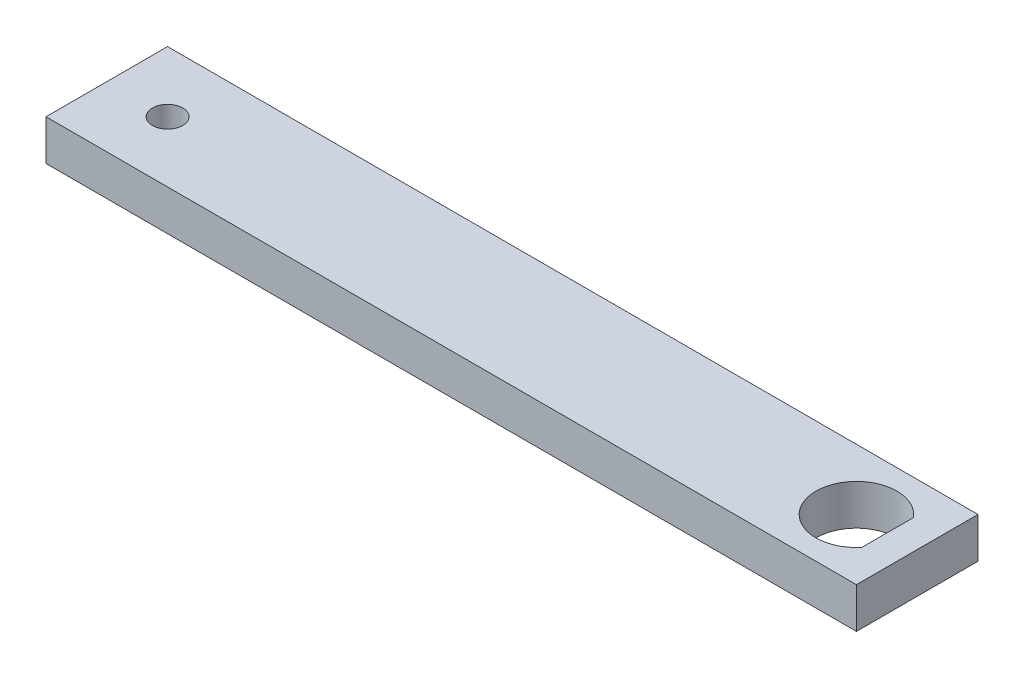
ISO-10303-21;
HEADER;
FILE_DESCRIPTION(('STEP AP214'),'2;1');
FILE_NAME('part.step','',(''),(''),'','','');
FILE_SCHEMA(('AUTOMOTIVE_DESIGN { 1 0 10303 214 1 1 1 1 }'));
ENDSEC;
DATA;
#1=APPLICATION_CONTEXT('core data for automotive mechanical design processes');
#2=APPLICATION_PROTOCOL_DEFINITION('international standard','automotive_design',2000,#1);
#3=PRODUCT_CONTEXT('',#1,'mechanical');
#4=PRODUCT('Part','Part','',(#3));
#5=PRODUCT_RELATED_PRODUCT_CATEGORY('part','',(#4));
#6=PRODUCT_DEFINITION_FORMATION('','',#4);
#7=PRODUCT_DEFINITION_CONTEXT('part definition',#1,'design');
#8=PRODUCT_DEFINITION('design','',#6,#7);
#9=PRODUCT_DEFINITION_SHAPE('','',#8);
#10=(LENGTH_UNIT() NAMED_UNIT(*) SI_UNIT(.MILLI.,.METRE.));
#11=(NAMED_UNIT(*) PLANE_ANGLE_UNIT() SI_UNIT($,.RADIAN.));
#12=(NAMED_UNIT(*) SI_UNIT($,.STERADIAN.) SOLID_ANGLE_UNIT());
#13=UNCERTAINTY_MEASURE_WITH_UNIT(LENGTH_MEASURE(1.E-05),#10,'distance_accuracy_value','');
#14=(GEOMETRIC_REPRESENTATION_CONTEXT(3) GLOBAL_UNCERTAINTY_ASSIGNED_CONTEXT((#13)) GLOBAL_UNIT_ASSIGNED_CONTEXT((#10,
#11,#12)) REPRESENTATION_CONTEXT('',''));
#15=CARTESIAN_POINT('',(0.,0.,0.));
#16=DIRECTION('',(0.,0.,1.));
#17=DIRECTION('',(1.,0.,0.));
#18=AXIS2_PLACEMENT_3D('',#15,#16,#17);
#19=CARTESIAN_POINT('',(0.,0.,19.05));
#20=DIRECTION('',(-1.,0.,0.));
#21=DIRECTION('',(0.,0.,1.));
#22=AXIS2_PLACEMENT_3D('',#19,#20,#21);
#23=PLANE('',#22);
#24=DIRECTION('',(0.,1.,0.));
#25=VECTOR('',#24,1.);
#26=CARTESIAN_POINT('',(0.,0.,0.));
#27=LINE('',#26,#25);
#28=CARTESIAN_POINT('',(0.,0.,0.));
#29=VERTEX_POINT('',#28);
#30=CARTESIAN_POINT('',(0.,6.35000000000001,0.));
#31=VERTEX_POINT('',#30);
#32=EDGE_CURVE('E86',#29,#31,#27,.T.);
#33=ORIENTED_EDGE('',*,*,#32,.F.);
#34=DIRECTION('',(0.,0.,-1.));
#35=VECTOR('',#34,1.);
#36=CARTESIAN_POINT('',(0.,0.,19.05));
#37=LINE('',#36,#35);
#38=CARTESIAN_POINT('',(0.,0.,19.05));
#39=VERTEX_POINT('',#38);
#40=EDGE_CURVE('E11',#39,#29,#37,.T.);
#41=ORIENTED_EDGE('',*,*,#40,.F.);
#42=DIRECTION('',(0.,1.,0.));
#43=VECTOR('',#42,1.);
#44=CARTESIAN_POINT('',(0.,0.,19.05));
#45=LINE('',#44,#43);
#46=CARTESIAN_POINT('',(0.,6.35000000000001,19.05));
#47=VERTEX_POINT('',#46);
#48=EDGE_CURVE('E118',#39,#47,#45,.T.);
#49=ORIENTED_EDGE('',*,*,#48,.T.);
#50=DIRECTION('',(0.,0.,-1.));
#51=VECTOR('',#50,1.);
#52=CARTESIAN_POINT('',(0.,6.35000000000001,19.05));
#53=LINE('',#52,#51);
#54=EDGE_CURVE('E34',#47,#31,#53,.T.);
#55=ORIENTED_EDGE('',*,*,#54,.T.);
#56=EDGE_LOOP('',(#33,#41,#49,#55));
#57=FACE_BOUND('',#56,.T.);
#58=ADVANCED_FACE('F31',(#57),#23,.T.);
#59=CARTESIAN_POINT('',(0.,0.,19.05));
#60=DIRECTION('',(0.,1.,0.));
#61=DIRECTION('',(0.,0.,1.));
#62=AXIS2_PLACEMENT_3D('',#59,#60,#61);
#63=PLANE('',#62);
#64=CARTESIAN_POINT('',(9.525,0.,9.525));
#65=DIRECTION('',(0.,1.,0.));
#66=DIRECTION('',(-1.,0.,0.));
#67=AXIS2_PLACEMENT_3D('',#64,#65,#66);
#68=CIRCLE('',#67,2.38125);
#69=CARTESIAN_POINT('',(7.14375,0.,9.525));
#70=VERTEX_POINT('',#69);
#71=EDGE_CURVE('E96',#70,#70,#68,.T.);
#72=ORIENTED_EDGE('',*,*,#71,.T.);
#73=EDGE_LOOP('',(#72));
#74=FACE_BOUND('',#73,.T.);
#75=DIRECTION('',(0.,0.,1.));
#76=VECTOR('',#75,1.);
#77=CARTESIAN_POINT('',(122.3645,0.,5.47342132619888));
#78=LINE('',#77,#76);
#79=CARTESIAN_POINT('',(122.3645,0.,5.47342132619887));
#80=VERTEX_POINT('',#79);
#81=CARTESIAN_POINT('',(122.3645,0.,13.5765786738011));
#82=VERTEX_POINT('',#81);
#83=EDGE_CURVE('E104',#80,#82,#78,.T.);
#84=ORIENTED_EDGE('',*,*,#83,.F.);
#85=CARTESIAN_POINT('',(117.475,0.,9.525));
#86=DIRECTION('',(0.,1.,0.));
#87=DIRECTION('',(-1.,0.,0.));
#88=AXIS2_PLACEMENT_3D('',#85,#86,#87);
#89=CIRCLE('',#88,6.35);
#90=EDGE_CURVE('E47',#80,#82,#89,.T.);
#91=ORIENTED_EDGE('',*,*,#90,.T.);
#92=EDGE_LOOP('',(#84,#91));
#93=FACE_BOUND('',#92,.T.);
#94=DIRECTION('',(1.,0.,0.));
#95=VECTOR('',#94,1.);
#96=CARTESIAN_POINT('',(0.,0.,0.));
#97=LINE('',#96,#95);
#98=CARTESIAN_POINT('',(127.,0.,0.));
#99=VERTEX_POINT('',#98);
#100=EDGE_CURVE('E115',#29,#99,#97,.T.);
#101=ORIENTED_EDGE('',*,*,#100,.T.);
#102=DIRECTION('',(0.,0.,-1.));
#103=VECTOR('',#102,1.);
#104=CARTESIAN_POINT('',(127.,0.,19.05));
#105=LINE('',#104,#103);
#106=CARTESIAN_POINT('',(127.,0.,19.05));
#107=VERTEX_POINT('',#106);
#108=EDGE_CURVE('E39',#107,#99,#105,.T.);
#109=ORIENTED_EDGE('',*,*,#108,.F.);
#110=DIRECTION('',(1.,0.,0.));
#111=VECTOR('',#110,1.);
#112=CARTESIAN_POINT('',(0.,0.,19.05));
#113=LINE('',#112,#111);
#114=EDGE_CURVE('E126',#39,#107,#113,.T.);
#115=ORIENTED_EDGE('',*,*,#114,.F.);
#116=ORIENTED_EDGE('',*,*,#40,.T.);
#117=EDGE_LOOP('',(#101,#109,#115,#116));
#118=FACE_BOUND('',#117,.T.);
#119=ADVANCED_FACE('F141',(#74,#93,#118),#63,.F.);
#120=CARTESIAN_POINT('',(127.,6.34999999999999,19.05));
#121=DIRECTION('',(1.,0.,0.));
#122=DIRECTION('',(0.,0.,-1.));
#123=AXIS2_PLACEMENT_3D('',#120,#121,#122);
#124=PLANE('',#123);
#125=DIRECTION('',(0.,-1.,0.));
#126=VECTOR('',#125,1.);
#127=CARTESIAN_POINT('',(127.,6.34999999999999,0.));
#128=LINE('',#127,#126);
#129=CARTESIAN_POINT('',(127.,6.34999999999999,0.));
#130=VERTEX_POINT('',#129);
#131=EDGE_CURVE('E112',#130,#99,#128,.T.);
#132=ORIENTED_EDGE('',*,*,#131,.F.);
#133=DIRECTION('',(0.,0.,-1.));
#134=VECTOR('',#133,1.);
#135=CARTESIAN_POINT('',(127.,6.34999999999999,19.05));
#136=LINE('',#135,#134);
#137=CARTESIAN_POINT('',(127.,6.34999999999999,19.05));
#138=VERTEX_POINT('',#137);
#139=EDGE_CURVE('E128',#138,#130,#136,.T.);
#140=ORIENTED_EDGE('',*,*,#139,.F.);
#141=DIRECTION('',(0.,-1.,0.));
#142=VECTOR('',#141,1.);
#143=CARTESIAN_POINT('',(127.,6.34999999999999,19.05));
#144=LINE('',#143,#142);
#145=EDGE_CURVE('E123',#138,#107,#144,.T.);
#146=ORIENTED_EDGE('',*,*,#145,.T.);
#147=ORIENTED_EDGE('',*,*,#108,.T.);
#148=EDGE_LOOP('',(#132,#140,#146,#147));
#149=FACE_BOUND('',#148,.T.);
#150=ADVANCED_FACE('F147',(#149),#124,.T.);
#151=CARTESIAN_POINT('',(127.,6.34999999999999,19.05));
#152=DIRECTION('',(0.,-1.,0.));
#153=DIRECTION('',(1.,0.,0.));
#154=AXIS2_PLACEMENT_3D('',#151,#152,#153);
#155=PLANE('',#154);
#156=CARTESIAN_POINT('',(9.525,6.35000000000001,9.525));
#157=DIRECTION('',(0.,1.,0.));
#158=DIRECTION('',(-1.,0.,0.));
#159=AXIS2_PLACEMENT_3D('',#156,#157,#158);
#160=CIRCLE('',#159,2.38125);
#161=CARTESIAN_POINT('',(7.14375,6.35000000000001,9.525));
#162=VERTEX_POINT('',#161);
#163=EDGE_CURVE('E99',#162,#162,#160,.T.);
#164=ORIENTED_EDGE('',*,*,#163,.F.);
#165=EDGE_LOOP('',(#164));
#166=FACE_BOUND('',#165,.T.);
#167=DIRECTION('',(0.,0.,1.));
#168=VECTOR('',#167,1.);
#169=CARTESIAN_POINT('',(122.3645,6.35,5.47342132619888));
#170=LINE('',#169,#168);
#171=CARTESIAN_POINT('',(122.3645,6.35,5.47342132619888));
#172=VERTEX_POINT('',#171);
#173=CARTESIAN_POINT('',(122.3645,6.35,13.5765786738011));
#174=VERTEX_POINT('',#173);
#175=EDGE_CURVE('E90',#172,#174,#170,.T.);
#176=ORIENTED_EDGE('',*,*,#175,.T.);
#177=CARTESIAN_POINT('',(117.475,6.35,9.525));
#178=DIRECTION('',(0.,1.,0.));
#179=DIRECTION('',(-1.,0.,0.));
#180=AXIS2_PLACEMENT_3D('',#177,#178,#179);
#181=CIRCLE('',#180,6.35);
#182=EDGE_CURVE('E52',#172,#174,#181,.T.);
#183=ORIENTED_EDGE('',*,*,#182,.F.);
#184=EDGE_LOOP('',(#176,#183));
#185=FACE_BOUND('',#184,.T.);
#186=DIRECTION('',(-1.,0.,0.));
#187=VECTOR('',#186,1.);
#188=CARTESIAN_POINT('',(127.,6.34999999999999,0.));
#189=LINE('',#188,#187);
#190=EDGE_CURVE('E109',#130,#31,#189,.T.);
#191=ORIENTED_EDGE('',*,*,#190,.T.);
#192=ORIENTED_EDGE('',*,*,#54,.F.);
#193=DIRECTION('',(-1.,0.,0.));
#194=VECTOR('',#193,1.);
#195=CARTESIAN_POINT('',(127.,6.34999999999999,19.05));
#196=LINE('',#195,#194);
#197=EDGE_CURVE('E121',#138,#47,#196,.T.);
#198=ORIENTED_EDGE('',*,*,#197,.F.);
#199=ORIENTED_EDGE('',*,*,#139,.T.);
#200=EDGE_LOOP('',(#191,#192,#198,#199));
#201=FACE_BOUND('',#200,.T.);
#202=ADVANCED_FACE('F94',(#166,#185,#201),#155,.F.);
#203=CARTESIAN_POINT('',(0.,0.,19.05));
#204=DIRECTION('',(0.,0.,-1.));
#205=DIRECTION('',(-1.,0.,0.));
#206=AXIS2_PLACEMENT_3D('',#203,#204,#205);
#207=PLANE('',#206);
#208=ORIENTED_EDGE('',*,*,#48,.F.);
#209=ORIENTED_EDGE('',*,*,#114,.T.);
#210=ORIENTED_EDGE('',*,*,#145,.F.);
#211=ORIENTED_EDGE('',*,*,#197,.T.);
#212=EDGE_LOOP('',(#208,#209,#210,#211));
#213=FACE_BOUND('',#212,.T.);
#214=ADVANCED_FACE('F145',(#213),#207,.F.);
#215=CARTESIAN_POINT('',(0.,0.,0.));
#216=DIRECTION('',(0.,0.,-1.));
#217=DIRECTION('',(-1.,0.,0.));
#218=AXIS2_PLACEMENT_3D('',#215,#216,#217);
#219=PLANE('',#218);
#220=ORIENTED_EDGE('',*,*,#32,.T.);
#221=ORIENTED_EDGE('',*,*,#190,.F.);
#222=ORIENTED_EDGE('',*,*,#131,.T.);
#223=ORIENTED_EDGE('',*,*,#100,.F.);
#224=EDGE_LOOP('',(#220,#221,#222,#223));
#225=FACE_BOUND('',#224,.T.);
#226=ADVANCED_FACE('F138',(#225),#219,.T.);
#227=CARTESIAN_POINT('',(117.475,0.,9.525));
#228=DIRECTION('',(0.,1.,0.));
#229=DIRECTION('',(-1.,0.,0.));
#230=AXIS2_PLACEMENT_3D('',#227,#228,#229);
#231=CYLINDRICAL_SURFACE('',#230,6.35);
#232=ORIENTED_EDGE('',*,*,#182,.T.);
#233=DIRECTION('',(0.,1.,0.));
#234=VECTOR('',#233,1.);
#235=CARTESIAN_POINT('',(122.3645,0.,13.5765786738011));
#236=LINE('',#235,#234);
#237=EDGE_CURVE('E87',#82,#174,#236,.T.);
#238=ORIENTED_EDGE('',*,*,#237,.F.);
#239=ORIENTED_EDGE('',*,*,#90,.F.);
#240=DIRECTION('',(0.,1.,0.));
#241=VECTOR('',#240,1.);
#242=CARTESIAN_POINT('',(122.3645,0.,5.47342132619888));
#243=LINE('',#242,#241);
#244=EDGE_CURVE('E81',#80,#172,#243,.T.);
#245=ORIENTED_EDGE('',*,*,#244,.T.);
#246=EDGE_LOOP('',(#232,#238,#239,#245));
#247=FACE_BOUND('',#246,.T.);
#248=ADVANCED_FACE('F83',(#247),#231,.F.);
#249=CARTESIAN_POINT('',(122.3645,0.,5.47342132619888));
#250=DIRECTION('',(-1.,0.,0.));
#251=DIRECTION('',(0.,-1.,0.));
#252=AXIS2_PLACEMENT_3D('',#249,#250,#251);
#253=PLANE('',#252);
#254=ORIENTED_EDGE('',*,*,#175,.F.);
#255=ORIENTED_EDGE('',*,*,#244,.F.);
#256=ORIENTED_EDGE('',*,*,#83,.T.);
#257=ORIENTED_EDGE('',*,*,#237,.T.);
#258=EDGE_LOOP('',(#254,#255,#256,#257));
#259=FACE_BOUND('',#258,.T.);
#260=ADVANCED_FACE('F91',(#259),#253,.T.);
#261=CARTESIAN_POINT('',(9.525,0.,9.525));
#262=DIRECTION('',(0.,1.,0.));
#263=DIRECTION('',(-1.,0.,0.));
#264=AXIS2_PLACEMENT_3D('',#261,#262,#263);
#265=CYLINDRICAL_SURFACE('',#264,2.38125);
#266=CARTESIAN_POINT('',(7.14375,0.,9.525));
#267=CARTESIAN_POINT('',(7.14375,0.0661458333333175,9.525));
#268=CARTESIAN_POINT('',(7.14375,0.132291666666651,9.525));
#269=CARTESIAN_POINT('',(7.14375,0.264583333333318,9.525));
#270=CARTESIAN_POINT('',(7.14375,0.330729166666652,9.525));
#271=CARTESIAN_POINT('',(7.14375,0.463020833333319,9.525));
#272=CARTESIAN_POINT('',(7.14375,0.529166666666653,9.525));
#273=CARTESIAN_POINT('',(7.14375,0.66145833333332,9.525));
#274=CARTESIAN_POINT('',(7.14375,0.727604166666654,9.525));
#275=CARTESIAN_POINT('',(7.14375,0.859895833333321,9.525));
#276=CARTESIAN_POINT('',(7.14375,0.926041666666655,9.525));
#277=CARTESIAN_POINT('',(7.14375,1.05833333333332,9.525));
#278=CARTESIAN_POINT('',(7.14375,1.12447916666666,9.525));
#279=CARTESIAN_POINT('',(7.14375,1.25677083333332,9.525));
#280=CARTESIAN_POINT('',(7.14375,1.32291666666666,9.525));
#281=CARTESIAN_POINT('',(7.14375,1.45520833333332,9.525));
#282=CARTESIAN_POINT('',(7.14375,1.52135416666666,9.525));
#283=CARTESIAN_POINT('',(7.14375,1.65364583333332,9.525));
#284=CARTESIAN_POINT('',(7.14375,1.71979166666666,9.525));
#285=CARTESIAN_POINT('',(7.14375,1.85208333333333,9.525));
#286=CARTESIAN_POINT('',(7.14375,1.91822916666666,9.525));
#287=CARTESIAN_POINT('',(7.14375,2.05052083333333,9.525));
#288=CARTESIAN_POINT('',(7.14375,2.11666666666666,9.525));
#289=CARTESIAN_POINT('',(7.14375,2.24895833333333,9.525));
#290=CARTESIAN_POINT('',(7.14375,2.31510416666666,9.525));
#291=CARTESIAN_POINT('',(7.14375,2.44739583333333,9.525));
#292=CARTESIAN_POINT('',(7.14375,2.51354166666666,9.525));
#293=CARTESIAN_POINT('',(7.14375,2.64583333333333,9.525));
#294=CARTESIAN_POINT('',(7.14375,2.71197916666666,9.525));
#295=CARTESIAN_POINT('',(7.14375,2.84427083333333,9.525));
#296=CARTESIAN_POINT('',(7.14375,2.91041666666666,9.525));
#297=CARTESIAN_POINT('',(7.14375,3.04270833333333,9.525));
#298=CARTESIAN_POINT('',(7.14375,3.10885416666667,9.525));
#299=CARTESIAN_POINT('',(7.14375,3.24114583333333,9.525));
#300=CARTESIAN_POINT('',(7.14375,3.30729166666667,9.525));
#301=CARTESIAN_POINT('',(7.14375,3.43958333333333,9.525));
#302=CARTESIAN_POINT('',(7.14375,3.50572916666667,9.525));
#303=CARTESIAN_POINT('',(7.14375,3.63802083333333,9.525));
#304=CARTESIAN_POINT('',(7.14375,3.70416666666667,9.525));
#305=CARTESIAN_POINT('',(7.14375,3.83645833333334,9.525));
#306=CARTESIAN_POINT('',(7.14375,3.90260416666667,9.525));
#307=CARTESIAN_POINT('',(7.14375,4.03489583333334,9.525));
#308=CARTESIAN_POINT('',(7.14375,4.10104166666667,9.525));
#309=CARTESIAN_POINT('',(7.14375,4.23333333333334,9.525));
#310=CARTESIAN_POINT('',(7.14375,4.29947916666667,9.525));
#311=CARTESIAN_POINT('',(7.14375,4.43177083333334,9.525));
#312=CARTESIAN_POINT('',(7.14375,4.49791666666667,9.525));
#313=CARTESIAN_POINT('',(7.14375,4.63020833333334,9.525));
#314=CARTESIAN_POINT('',(7.14375,4.69635416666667,9.525));
#315=CARTESIAN_POINT('',(7.14375,4.82864583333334,9.525));
#316=CARTESIAN_POINT('',(7.14375,4.89479166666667,9.525));
#317=CARTESIAN_POINT('',(7.14375,5.02708333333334,9.525));
#318=CARTESIAN_POINT('',(7.14375,5.09322916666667,9.525));
#319=CARTESIAN_POINT('',(7.14375,5.22552083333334,9.525));
#320=CARTESIAN_POINT('',(7.14375,5.29166666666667,9.525));
#321=CARTESIAN_POINT('',(7.14375,5.42395833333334,9.525));
#322=CARTESIAN_POINT('',(7.14375,5.49010416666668,9.525));
#323=CARTESIAN_POINT('',(7.14375,5.62239583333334,9.525));
#324=CARTESIAN_POINT('',(7.14375,5.68854166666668,9.525));
#325=CARTESIAN_POINT('',(7.14375,5.82083333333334,9.525));
#326=CARTESIAN_POINT('',(7.14375,5.88697916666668,9.525));
#327=CARTESIAN_POINT('',(7.14375,6.01927083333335,9.525));
#328=CARTESIAN_POINT('',(7.14375,6.08541666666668,9.525));
#329=CARTESIAN_POINT('',(7.14375,6.21770833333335,9.525));
#330=CARTESIAN_POINT('',(7.14375,6.28385416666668,9.525));
#331=CARTESIAN_POINT('',(7.14375,6.35000000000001,9.525));
#332=B_SPLINE_CURVE_WITH_KNOTS('',3,(#266,#267,#268,#269,#270,#271,#272,#273,#274,#275,#276,
#277,#278,#279,#280,#281,#282,#283,#284,#285,#286,#287,#288,#289,#290,#291,#292,#293,#294,#295,
#296,#297,#298,#299,#300,#301,#302,#303,#304,#305,#306,#307,#308,#309,#310,#311,#312,#313,#314,
#315,#316,#317,#318,#319,#320,#321,#322,#323,#324,#325,#326,#327,#328,#329,#330,#331),
.UNSPECIFIED.,.F.,.F.,(4,2,2,2,2,2,2,2,2,2,2,2,2,2,2,2,2,2,2,2,2,2,2,2,2,2,2,2,2,2,2,2,4),(0.,
0.198437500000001,0.396875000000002,0.595312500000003,0.793750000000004,0.992187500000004,
1.19062500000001,1.38906250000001,1.58750000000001,1.78593750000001,1.98437500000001,
2.18281250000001,2.38125000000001,2.57968750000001,2.77812500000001,2.97656250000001,
3.17500000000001,3.37343750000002,3.57187500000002,3.77031250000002,3.96875000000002,
4.16718750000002,4.36562500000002,4.56406250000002,4.76250000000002,4.96093750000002,
5.15937500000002,5.35781250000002,5.55625000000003,5.75468750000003,5.95312500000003,
6.15156250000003,6.35000000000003),.UNSPECIFIED.);
#333=EDGE_CURVE('BSEAM183',#70,#162,#332,.T.);
#334=ORIENTED_EDGE('',*,*,#71,.F.);
#335=ORIENTED_EDGE('',*,*,#163,.T.);
#336=ORIENTED_EDGE('',*,*,#333,.T.);
#337=ORIENTED_EDGE('',*,*,#333,.F.);
#338=EDGE_LOOP('',(#334,#336,#335,#337));
#339=FACE_BOUND('',#338,.T.);
#340=ADVANCED_FACE('F183',(#339),#265,.F.);
#341=CLOSED_SHELL('',(#58,#119,#150,#202,#214,#226,#248,#260,#340));
#342=MANIFOLD_SOLID_BREP('B2',#341);
#343=ADVANCED_BREP_SHAPE_REPRESENTATION('',(#18,#342),#14);
#344=SHAPE_DEFINITION_REPRESENTATION(#9,#343);
ENDSEC;
END-ISO-10303-21;
